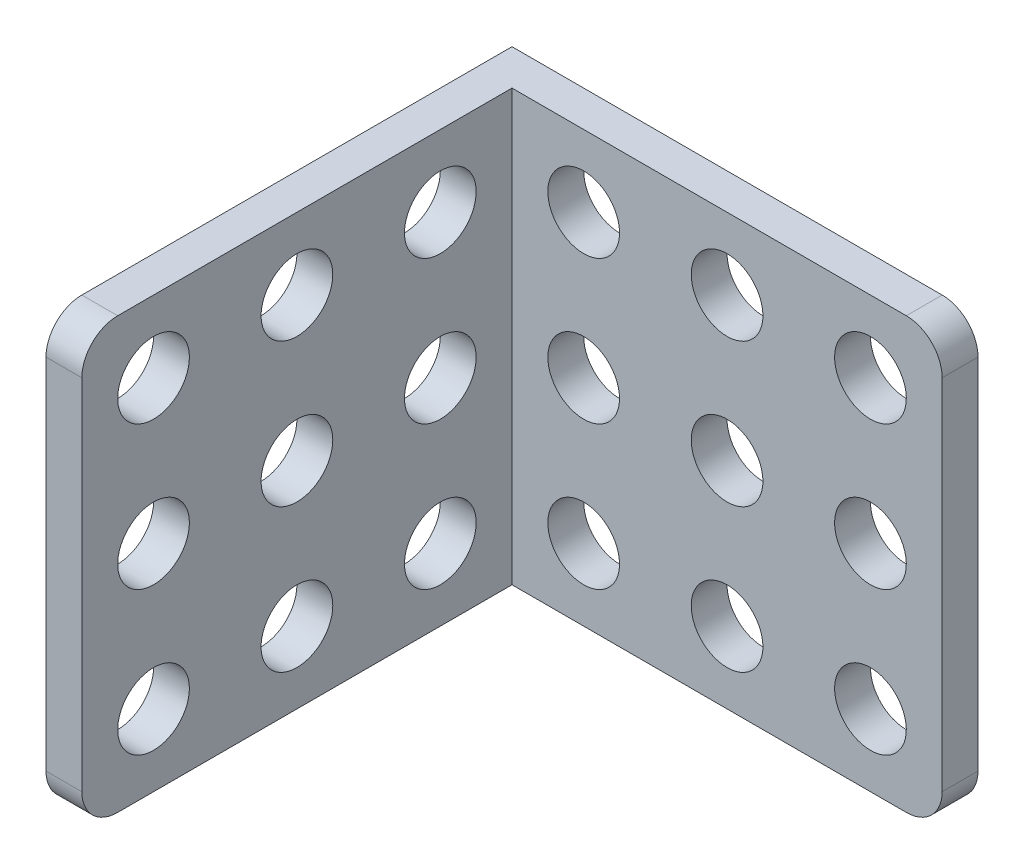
from build123d import *

# Parameters (mm, degrees)
SKETCH_1_W            = 26
SKETCH_1_H            = 24
EXTRUDE_1_DEPTH       = 2
SKETCH_2_W            = 2
SKETCH_2_H            = 24
EXTRUDE_2_DEPTH       = 24
FILLET_1_R            = 2
HOLE_WIZARD_4_0_4_1_D = 4


with BuildPart() as part:
    # Sketch 1 → Extrude 1 (new body)
    with BuildSketch(Plane.XY):
        Rectangle(SKETCH_1_W, SKETCH_1_H)
    extrude(amount=EXTRUDE_1_DEPTH)

    # Sketch 2 → Extrude 2 (add)
    with BuildSketch(Plane.XY.offset(2)):
        with Locations((-12, 0)):
            Rectangle(SKETCH_2_W, SKETCH_2_H)
    extrude(amount=EXTRUDE_2_DEPTH)

    # Fillet 1
    fillet_1_edges = [part.edges().sort_by_distance(p)[0] for p in [
        (-12, -12, 26),
        (-12, 12, 26),
        (13, -12, 1),
        (13, 12, 1),
    ]]
    fillet(fillet_1_edges, radius=FILLET_1_R)

    # Hole Wizard 4.0 _4_ _1 (through all)
    with Locations(Plane(origin=(-11, 0, 0), x_dir=(0, 0, -1), z_dir=(1, 0, 0))):
        with Locations((-6, 0), (-14, 0), (-22, 0), (-22, 8), (-14, 8), (-6, 8), (-6, -8), (-14, -8), (-22, -8)):
            hole_wizard_4_0_4_1 = Hole(HOLE_WIZARD_4_0_4_1_D / 2)

    # Mirror 1: Hole Wizard 4.0 _4_ _1 across plane
    add(hole_wizard_4_0_4_1.mirror(Plane(origin=(-6.5, 0, 6.5), x_dir=(0.7071067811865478, 0, 0.7071067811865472), z_dir=(0.7071067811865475, 0, -0.7071067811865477))), mode=Mode.SUBTRACT)


solid = part.part
